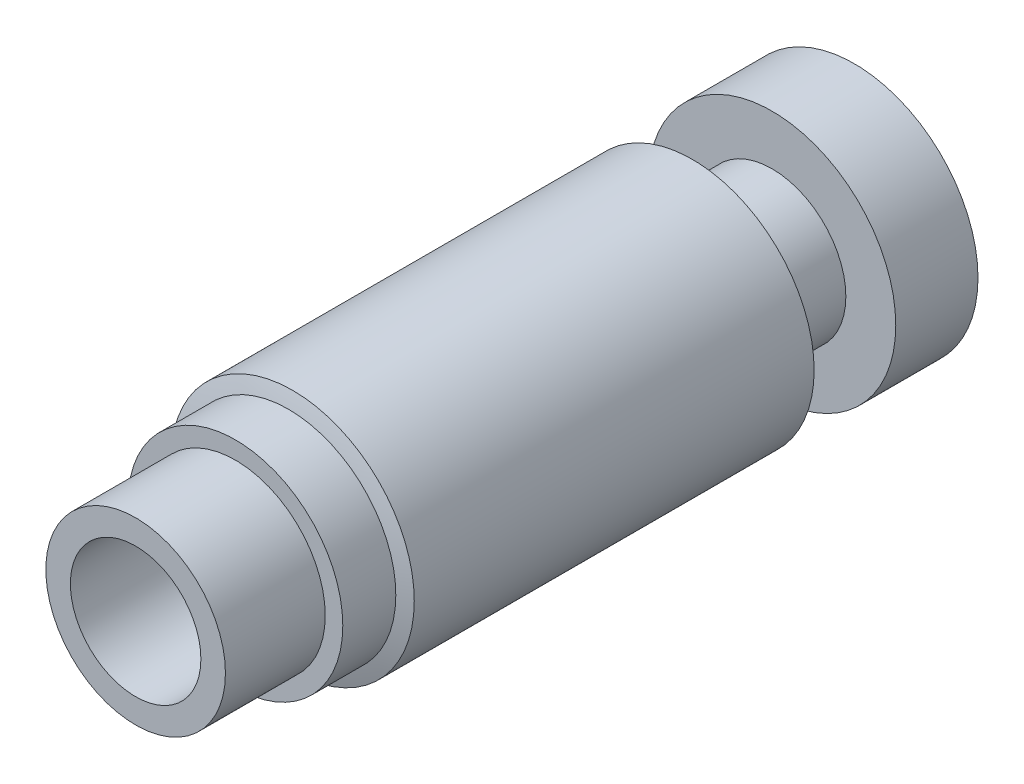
from build123d import *
from build123d.topology import SkipClean

# Parameters (mm, degrees)
SKETCH3_R                       = 16.002
EXTRUDE2_DEPTH                  = 10.640129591
SKETCH4_R                       = 13.889712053
EXTRUDE3_DEPTH                  = 5.042146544
EXTRUDE3_DIRECTION_2_REACH      = 80.372
EXTRUDE3_DIRECTION_2_END_RADIUS = 53.989259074
SKETCH5_R                       = 11.618476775
EXTRUDE4_DEPTH                  = 12.914041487
EXTRUDE6_DEPTH                  = 10.16
EXTRUDE6_DEPTH_BACK             = 96.703649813
SKETCH7_R                       = 8.443476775


with BuildPart() as part:
    # Sketch2 → Revolve1 (revolve)
    with BuildSketch(Plane(origin=(0, 0, 0), x_dir=(0, 0, -1), z_dir=(1, 0, 0)), mode=Mode.PRIVATE) as revolve1_sk:
        with BuildLine():
            Line((2.347797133, 15.748), (21.740031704, 15.748))
            Line((21.740031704, 15.748), (54.087267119, 15.748))
            Line((54.087267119, 15.748), (54.087267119, 9.544174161))
            Line((54.087267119, 9.544174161), (64.393254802, 9.544174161))
            Line((64.393254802, 9.544174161), (64.393254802, 0))
            Line((64.393254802, 0), (0, 0))
            ThreePointArc((0, 0), (0.590174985, 7.961024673), (2.347797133, 15.748))
        make_face()
    revolve(revolve1_sk.sketch.rotate(Axis((0, 0, 0), (0, 0, -1)), 90), axis=Axis((0, 0, 0), (0, 0, -1)))

    # Sketch3 → Extrude2 (add)
    with BuildSketch(Plane(origin=(0, 0, -64.393254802), x_dir=(-1, 0, 0), z_dir=(0, 0, -1))):
        Circle(SKETCH3_R)
    extrude(amount=EXTRUDE2_DEPTH)

    # Sketch4 → Extrude3 (add)
    with BuildSketch(Plane.XY):
        Circle(SKETCH4_R)
    extrude(amount=EXTRUDE3_DEPTH)

    # Extrude3 direction 2: up to this sphere (the profile starts outside it)
    with SkipClean():  # the faces are left unmerged after this step: merging them gives an invalid solid
        extrude3_direction_2_end = Location((0, 0, -53.989259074)) * Sphere(EXTRUDE3_DIRECTION_2_END_RADIUS, mode=Mode.PRIVATE)
        # Sketch4 → Extrude3 direction 2 (add, up to the surface)
        with BuildSketch(Plane.XY, mode=Mode.PRIVATE) as extrude3_direction_2_sk1:
            Circle(SKETCH4_R)
        extrude3_direction_2_tool1 = extrude(extrude3_direction_2_sk1.sketch, amount=-EXTRUDE3_DIRECTION_2_REACH, mode=Mode.PRIVATE) - extrude3_direction_2_end
        add(extrude3_direction_2_tool1.solids().sort_by_distance((0, 0, 0))[0])

    # Sketch5 → Extrude4 (add)
    with BuildSketch(Plane.XY.offset(5.042146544)):
        Circle(SKETCH5_R)
    extrude(amount=EXTRUDE4_DEPTH)

    # Sketch7 → Extrude6 (cut, two sides: drawn at the far end of the back side and taken through both)
    with BuildSketch(Plane.XY.offset(17.956188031).offset(-EXTRUDE6_DEPTH_BACK)):
        Circle(SKETCH7_R)
    extrude(amount=EXTRUDE6_DEPTH + EXTRUDE6_DEPTH_BACK, mode=Mode.SUBTRACT)


solid = part.part
